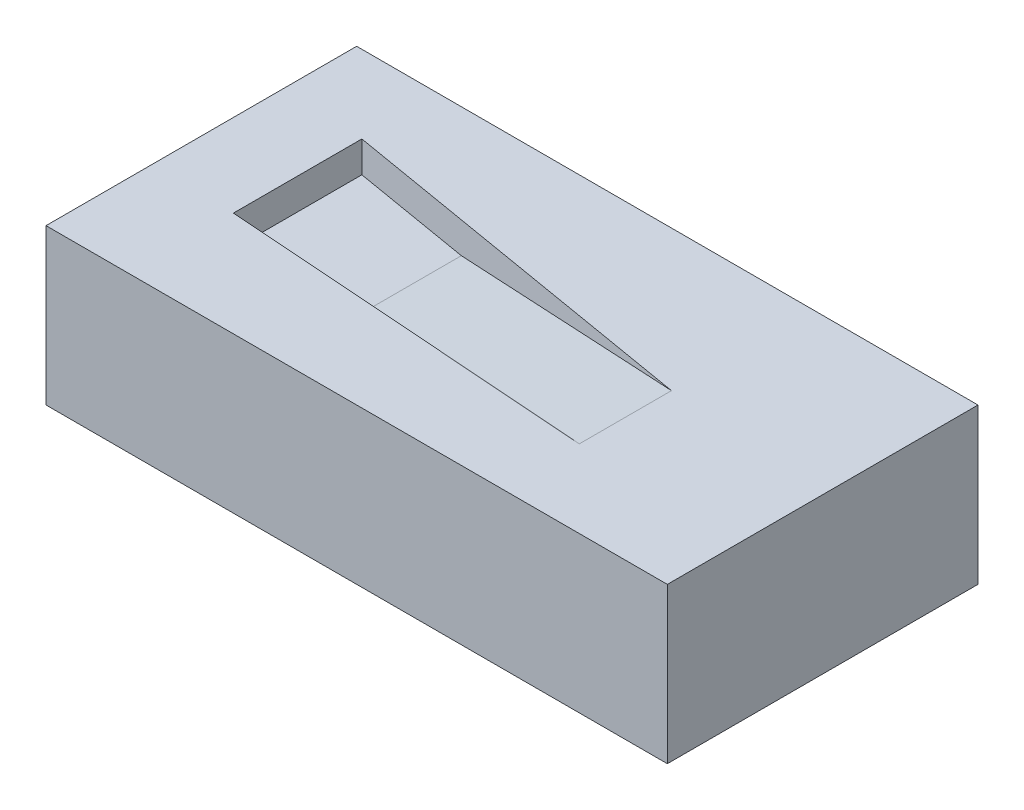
ISO-10303-21;
HEADER;
FILE_DESCRIPTION(('STEP AP214'),'2;1');
FILE_NAME('part.step','',(''),(''),'','','');
FILE_SCHEMA(('AUTOMOTIVE_DESIGN { 1 0 10303 214 1 1 1 1 }'));
ENDSEC;
DATA;
#1=APPLICATION_CONTEXT('core data for automotive mechanical design processes');
#2=APPLICATION_PROTOCOL_DEFINITION('international standard','automotive_design',2000,#1);
#3=PRODUCT_CONTEXT('',#1,'mechanical');
#4=PRODUCT('Part','Part','',(#3));
#5=PRODUCT_RELATED_PRODUCT_CATEGORY('part','',(#4));
#6=PRODUCT_DEFINITION_FORMATION('','',#4);
#7=PRODUCT_DEFINITION_CONTEXT('part definition',#1,'design');
#8=PRODUCT_DEFINITION('design','',#6,#7);
#9=PRODUCT_DEFINITION_SHAPE('','',#8);
#10=(LENGTH_UNIT() NAMED_UNIT(*) SI_UNIT(.MILLI.,.METRE.));
#11=(NAMED_UNIT(*) PLANE_ANGLE_UNIT() SI_UNIT($,.RADIAN.));
#12=(NAMED_UNIT(*) SI_UNIT($,.STERADIAN.) SOLID_ANGLE_UNIT());
#13=UNCERTAINTY_MEASURE_WITH_UNIT(LENGTH_MEASURE(1.E-05),#10,'distance_accuracy_value','');
#14=(GEOMETRIC_REPRESENTATION_CONTEXT(3) GLOBAL_UNCERTAINTY_ASSIGNED_CONTEXT((#13)) GLOBAL_UNIT_ASSIGNED_CONTEXT((#10,
#11,#12)) REPRESENTATION_CONTEXT('',''));
#15=CARTESIAN_POINT('',(0.,0.,0.));
#16=DIRECTION('',(0.,0.,1.));
#17=DIRECTION('',(1.,0.,0.));
#18=AXIS2_PLACEMENT_3D('',#15,#16,#17);
#19=CARTESIAN_POINT('',(0.,0.,-60.));
#20=DIRECTION('',(-1.,0.,0.));
#21=DIRECTION('',(0.,-1.,0.));
#22=AXIS2_PLACEMENT_3D('',#19,#20,#21);
#23=PLANE('',#22);
#24=DIRECTION('',(0.,-1.,0.));
#25=VECTOR('',#24,1.);
#26=CARTESIAN_POINT('',(0.,0.,0.));
#27=LINE('',#26,#25);
#28=CARTESIAN_POINT('',(0.,0.,0.));
#29=VERTEX_POINT('',#28);
#30=CARTESIAN_POINT('',(0.,-30.,0.));
#31=VERTEX_POINT('',#30);
#32=EDGE_CURVE('E132',#29,#31,#27,.T.);
#33=ORIENTED_EDGE('',*,*,#32,.F.);
#34=DIRECTION('',(0.,0.,1.));
#35=VECTOR('',#34,1.);
#36=CARTESIAN_POINT('',(0.,0.,-60.));
#37=LINE('',#36,#35);
#38=CARTESIAN_POINT('',(0.,0.,-60.));
#39=VERTEX_POINT('',#38);
#40=EDGE_CURVE('E11',#39,#29,#37,.T.);
#41=ORIENTED_EDGE('',*,*,#40,.F.);
#42=DIRECTION('',(0.,-1.,0.));
#43=VECTOR('',#42,1.);
#44=CARTESIAN_POINT('',(0.,0.,-60.));
#45=LINE('',#44,#43);
#46=CARTESIAN_POINT('',(0.,-30.,-60.));
#47=VERTEX_POINT('',#46);
#48=EDGE_CURVE('E136',#39,#47,#45,.T.);
#49=ORIENTED_EDGE('',*,*,#48,.T.);
#50=DIRECTION('',(0.,0.,1.));
#51=VECTOR('',#50,1.);
#52=CARTESIAN_POINT('',(0.,-30.,-60.));
#53=LINE('',#52,#51);
#54=EDGE_CURVE('E36',#47,#31,#53,.T.);
#55=ORIENTED_EDGE('',*,*,#54,.T.);
#56=EDGE_LOOP('',(#33,#41,#49,#55));
#57=FACE_BOUND('',#56,.T.);
#58=ADVANCED_FACE('F33',(#57),#23,.T.);
#59=CARTESIAN_POINT('',(0.,0.,-60.));
#60=DIRECTION('',(0.,-1.,0.));
#61=DIRECTION('',(0.,0.,-1.));
#62=AXIS2_PLACEMENT_3D('',#59,#60,#61);
#63=PLANE('',#62);
#64=DIRECTION('',(0.985948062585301,0.,0.167052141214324));
#65=VECTOR('',#64,1.);
#66=CARTESIAN_POINT('',(16.,0.,-45.));
#67=LINE('',#66,#65);
#68=CARTESIAN_POINT('',(16.,0.,-45.));
#69=VERTEX_POINT('',#68);
#70=CARTESIAN_POINT('',(88.,0.,-32.8008237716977));
#71=VERTEX_POINT('',#70);
#72=EDGE_CURVE('E102',#69,#71,#67,.T.);
#73=ORIENTED_EDGE('',*,*,#72,.T.);
#74=DIRECTION('',(0.,0.,1.));
#75=VECTOR('',#74,1.);
#76=CARTESIAN_POINT('',(88.,0.,-45.));
#77=LINE('',#76,#75);
#78=CARTESIAN_POINT('',(88.,0.,-15.));
#79=VERTEX_POINT('',#78);
#80=EDGE_CURVE('E49',#71,#79,#77,.T.);
#81=ORIENTED_EDGE('',*,*,#80,.T.);
#82=DIRECTION('',(-0.997405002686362,0.,-0.0719948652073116));
#83=VECTOR('',#82,1.);
#84=CARTESIAN_POINT('',(16.,0.,-20.1971167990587));
#85=LINE('',#84,#83);
#86=CARTESIAN_POINT('',(16.,0.,-20.1971167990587));
#87=VERTEX_POINT('',#86);
#88=EDGE_CURVE('E104',#79,#87,#85,.T.);
#89=ORIENTED_EDGE('',*,*,#88,.T.);
#90=DIRECTION('',(0.,0.,1.));
#91=VECTOR('',#90,1.);
#92=CARTESIAN_POINT('',(16.,0.,-45.));
#93=LINE('',#92,#91);
#94=EDGE_CURVE('E97',#69,#87,#93,.T.);
#95=ORIENTED_EDGE('',*,*,#94,.F.);
#96=EDGE_LOOP('',(#73,#81,#89,#95));
#97=FACE_BOUND('',#96,.T.);
#98=DIRECTION('',(1.,0.,0.));
#99=VECTOR('',#98,1.);
#100=CARTESIAN_POINT('',(0.,0.,0.));
#101=LINE('',#100,#99);
#102=CARTESIAN_POINT('',(120.,0.,0.));
#103=VERTEX_POINT('',#102);
#104=EDGE_CURVE('E140',#29,#103,#101,.T.);
#105=ORIENTED_EDGE('',*,*,#104,.T.);
#106=DIRECTION('',(0.,0.,1.));
#107=VECTOR('',#106,1.);
#108=CARTESIAN_POINT('',(120.,0.,-60.));
#109=LINE('',#108,#107);
#110=CARTESIAN_POINT('',(120.,0.,-60.));
#111=VERTEX_POINT('',#110);
#112=EDGE_CURVE('E41',#111,#103,#109,.T.);
#113=ORIENTED_EDGE('',*,*,#112,.F.);
#114=DIRECTION('',(1.,0.,0.));
#115=VECTOR('',#114,1.);
#116=CARTESIAN_POINT('',(0.,0.,-60.));
#117=LINE('',#116,#115);
#118=EDGE_CURVE('E145',#39,#111,#117,.T.);
#119=ORIENTED_EDGE('',*,*,#118,.F.);
#120=ORIENTED_EDGE('',*,*,#40,.T.);
#121=EDGE_LOOP('',(#105,#113,#119,#120));
#122=FACE_BOUND('',#121,.T.);
#123=ADVANCED_FACE('F99',(#97,#122),#63,.F.);
#124=CARTESIAN_POINT('',(120.,0.,-60.));
#125=DIRECTION('',(-1.,0.,0.));
#126=DIRECTION('',(0.,-1.,0.));
#127=AXIS2_PLACEMENT_3D('',#124,#125,#126);
#128=PLANE('',#127);
#129=DIRECTION('',(0.,-1.,0.));
#130=VECTOR('',#129,1.);
#131=CARTESIAN_POINT('',(120.,0.,0.));
#132=LINE('',#131,#130);
#133=CARTESIAN_POINT('',(120.,-30.,0.));
#134=VERTEX_POINT('',#133);
#135=EDGE_CURVE('E152',#103,#134,#132,.T.);
#136=ORIENTED_EDGE('',*,*,#135,.T.);
#137=DIRECTION('',(0.,0.,1.));
#138=VECTOR('',#137,1.);
#139=CARTESIAN_POINT('',(120.,-30.,-60.));
#140=LINE('',#139,#138);
#141=CARTESIAN_POINT('',(120.,-30.,-60.));
#142=VERTEX_POINT('',#141);
#143=EDGE_CURVE('E157',#142,#134,#140,.T.);
#144=ORIENTED_EDGE('',*,*,#143,.F.);
#145=DIRECTION('',(0.,-1.,0.));
#146=VECTOR('',#145,1.);
#147=CARTESIAN_POINT('',(120.,0.,-60.));
#148=LINE('',#147,#146);
#149=EDGE_CURVE('E143',#111,#142,#148,.T.);
#150=ORIENTED_EDGE('',*,*,#149,.F.);
#151=ORIENTED_EDGE('',*,*,#112,.T.);
#152=EDGE_LOOP('',(#136,#144,#150,#151));
#153=FACE_BOUND('',#152,.T.);
#154=ADVANCED_FACE('F174',(#153),#128,.F.);
#155=CARTESIAN_POINT('',(0.,-30.,-60.));
#156=DIRECTION('',(0.,-1.,0.));
#157=DIRECTION('',(0.,0.,-1.));
#158=AXIS2_PLACEMENT_3D('',#155,#156,#157);
#159=PLANE('',#158);
#160=DIRECTION('',(1.,0.,0.));
#161=VECTOR('',#160,1.);
#162=CARTESIAN_POINT('',(0.,-30.,0.));
#163=LINE('',#162,#161);
#164=EDGE_CURVE('E149',#31,#134,#163,.T.);
#165=ORIENTED_EDGE('',*,*,#164,.F.);
#166=ORIENTED_EDGE('',*,*,#54,.F.);
#167=DIRECTION('',(1.,0.,0.));
#168=VECTOR('',#167,1.);
#169=CARTESIAN_POINT('',(0.,-30.,-60.));
#170=LINE('',#169,#168);
#171=EDGE_CURVE('E139',#47,#142,#170,.T.);
#172=ORIENTED_EDGE('',*,*,#171,.T.);
#173=ORIENTED_EDGE('',*,*,#143,.T.);
#174=EDGE_LOOP('',(#165,#166,#172,#173));
#175=FACE_BOUND('',#174,.T.);
#176=ADVANCED_FACE('F165',(#175),#159,.T.);
#177=CARTESIAN_POINT('',(0.,-30.,-60.));
#178=DIRECTION('',(0.,0.,1.));
#179=DIRECTION('',(1.,0.,0.));
#180=AXIS2_PLACEMENT_3D('',#177,#178,#179);
#181=PLANE('',#180);
#182=ORIENTED_EDGE('',*,*,#48,.F.);
#183=ORIENTED_EDGE('',*,*,#118,.T.);
#184=ORIENTED_EDGE('',*,*,#149,.T.);
#185=ORIENTED_EDGE('',*,*,#171,.F.);
#186=EDGE_LOOP('',(#182,#183,#184,#185));
#187=FACE_BOUND('',#186,.T.);
#188=ADVANCED_FACE('F176',(#187),#181,.F.);
#189=CARTESIAN_POINT('',(0.,-30.,0.));
#190=DIRECTION('',(0.,0.,1.));
#191=DIRECTION('',(1.,0.,0.));
#192=AXIS2_PLACEMENT_3D('',#189,#190,#191);
#193=PLANE('',#192);
#194=ORIENTED_EDGE('',*,*,#32,.T.);
#195=ORIENTED_EDGE('',*,*,#164,.T.);
#196=ORIENTED_EDGE('',*,*,#135,.F.);
#197=ORIENTED_EDGE('',*,*,#104,.F.);
#198=EDGE_LOOP('',(#194,#195,#196,#197));
#199=FACE_BOUND('',#198,.T.);
#200=ADVANCED_FACE('F169',(#199),#193,.T.);
#201=CARTESIAN_POINT('',(-36.3196470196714,-15.2645332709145,-45.));
#202=DIRECTION('',(-0.121869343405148,0.992546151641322,0.));
#203=DIRECTION('',(-0.992546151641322,-0.121869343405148,0.));
#204=AXIS2_PLACEMENT_3D('',#201,#202,#203);
#205=PLANE('',#204);
#206=DIRECTION('',(0.978801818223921,0.120181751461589,0.165841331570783));
#207=VECTOR('',#206,1.);
#208=CARTESIAN_POINT('',(-34.8806815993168,-15.0878505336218,-53.6208666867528));
#209=LINE('',#208,#207);
#210=CARTESIAN_POINT('',(39.1339214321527,-6.,-41.0803502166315));
#211=VERTEX_POINT('',#210);
#212=EDGE_CURVE('E53',#211,#71,#209,.T.);
#213=ORIENTED_EDGE('',*,*,#212,.F.);
#214=DIRECTION('',(0.,0.,1.));
#215=VECTOR('',#214,1.);
#216=CARTESIAN_POINT('',(39.1339214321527,-6.,-45.));
#217=LINE('',#216,#215);
#218=CARTESIAN_POINT('',(39.1339214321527,-6.,-18.5272599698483));
#219=VERTEX_POINT('',#218);
#220=EDGE_CURVE('E133',#211,#219,#217,.T.);
#221=ORIENTED_EDGE('',*,*,#220,.T.);
#222=DIRECTION('',(-0.990008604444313,-0.121557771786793,-0.0714609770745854));
#223=VECTOR('',#222,1.);
#224=CARTESIAN_POINT('',(-37.8071969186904,-15.4471814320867,-24.081037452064));
#225=LINE('',#224,#223);
#226=EDGE_CURVE('E116',#79,#219,#225,.T.);
#227=ORIENTED_EDGE('',*,*,#226,.F.);
#228=ORIENTED_EDGE('',*,*,#80,.F.);
#229=EDGE_LOOP('',(#213,#221,#227,#228));
#230=FACE_BOUND('',#229,.T.);
#231=ADVANCED_FACE('F183',(#230),#205,.T.);
#232=CARTESIAN_POINT('',(-36.3521276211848,-6.,-45.));
#233=DIRECTION('',(0.,-1.,0.));
#234=DIRECTION('',(0.,0.,-1.));
#235=AXIS2_PLACEMENT_3D('',#232,#233,#234);
#236=PLANE('',#235);
#237=ORIENTED_EDGE('',*,*,#220,.F.);
#238=DIRECTION('',(0.985948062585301,0.,0.167052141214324));
#239=VECTOR('',#238,1.);
#240=CARTESIAN_POINT('',(16.,-6.,-45.));
#241=LINE('',#240,#239);
#242=CARTESIAN_POINT('',(16.,-6.,-45.));
#243=VERTEX_POINT('',#242);
#244=EDGE_CURVE('E119',#243,#211,#241,.T.);
#245=ORIENTED_EDGE('',*,*,#244,.F.);
#246=DIRECTION('',(0.,0.,1.));
#247=VECTOR('',#246,1.);
#248=CARTESIAN_POINT('',(16.,-6.,-45.));
#249=LINE('',#248,#247);
#250=CARTESIAN_POINT('',(16.,-6.,-20.1971167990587));
#251=VERTEX_POINT('',#250);
#252=EDGE_CURVE('E107',#243,#251,#249,.T.);
#253=ORIENTED_EDGE('',*,*,#252,.T.);
#254=DIRECTION('',(-0.997405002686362,0.,-0.0719948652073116));
#255=VECTOR('',#254,1.);
#256=CARTESIAN_POINT('',(16.,-6.,-20.1971167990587));
#257=LINE('',#256,#255);
#258=EDGE_CURVE('E124',#219,#251,#257,.T.);
#259=ORIENTED_EDGE('',*,*,#258,.F.);
#260=EDGE_LOOP('',(#237,#245,#253,#259));
#261=FACE_BOUND('',#260,.T.);
#262=ADVANCED_FACE('F227',(#261),#236,.F.);
#263=CARTESIAN_POINT('',(16.,-15.,-45.));
#264=DIRECTION('',(-1.,0.,0.));
#265=DIRECTION('',(0.,0.,1.));
#266=AXIS2_PLACEMENT_3D('',#263,#264,#265);
#267=PLANE('',#266);
#268=ORIENTED_EDGE('',*,*,#94,.T.);
#269=DIRECTION('',(0.,1.,0.));
#270=VECTOR('',#269,1.);
#271=CARTESIAN_POINT('',(16.,-6.,-20.1971167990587));
#272=LINE('',#271,#270);
#273=EDGE_CURVE('E126',#251,#87,#272,.T.);
#274=ORIENTED_EDGE('',*,*,#273,.F.);
#275=ORIENTED_EDGE('',*,*,#252,.F.);
#276=DIRECTION('',(0.,-1.,0.));
#277=VECTOR('',#276,1.);
#278=CARTESIAN_POINT('',(16.,-15.,-45.));
#279=LINE('',#278,#277);
#280=EDGE_CURVE('E108',#69,#243,#279,.T.);
#281=ORIENTED_EDGE('',*,*,#280,.F.);
#282=EDGE_LOOP('',(#268,#274,#275,#281));
#283=FACE_BOUND('',#282,.T.);
#284=ADVANCED_FACE('F112',(#283),#267,.F.);
#285=CARTESIAN_POINT('',(16.,-6.,-20.1971167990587));
#286=DIRECTION('',(0.0719948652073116,0.,-0.997405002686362));
#287=DIRECTION('',(-0.997405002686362,0.,-0.0719948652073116));
#288=AXIS2_PLACEMENT_3D('',#285,#286,#287);
#289=PLANE('',#288);
#290=ORIENTED_EDGE('',*,*,#88,.F.);
#291=ORIENTED_EDGE('',*,*,#226,.T.);
#292=ORIENTED_EDGE('',*,*,#258,.T.);
#293=ORIENTED_EDGE('',*,*,#273,.T.);
#294=EDGE_LOOP('',(#290,#291,#292,#293));
#295=FACE_BOUND('',#294,.T.);
#296=ADVANCED_FACE('F244',(#295),#289,.T.);
#297=CARTESIAN_POINT('',(16.,-6.,-45.));
#298=DIRECTION('',(-0.167052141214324,0.,0.985948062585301));
#299=DIRECTION('',(0.985948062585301,0.,0.167052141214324));
#300=AXIS2_PLACEMENT_3D('',#297,#298,#299);
#301=PLANE('',#300);
#302=ORIENTED_EDGE('',*,*,#244,.T.);
#303=ORIENTED_EDGE('',*,*,#212,.T.);
#304=ORIENTED_EDGE('',*,*,#72,.F.);
#305=ORIENTED_EDGE('',*,*,#280,.T.);
#306=EDGE_LOOP('',(#302,#303,#304,#305));
#307=FACE_BOUND('',#306,.T.);
#308=ADVANCED_FACE('F118',(#307),#301,.T.);
#309=CLOSED_SHELL('',(#58,#123,#154,#176,#188,#200,#231,#262,#284,#296,#308));
#310=MANIFOLD_SOLID_BREP('B2',#309);
#311=ADVANCED_BREP_SHAPE_REPRESENTATION('',(#18,#310),#14);
#312=SHAPE_DEFINITION_REPRESENTATION(#9,#311);
ENDSEC;
END-ISO-10303-21;
